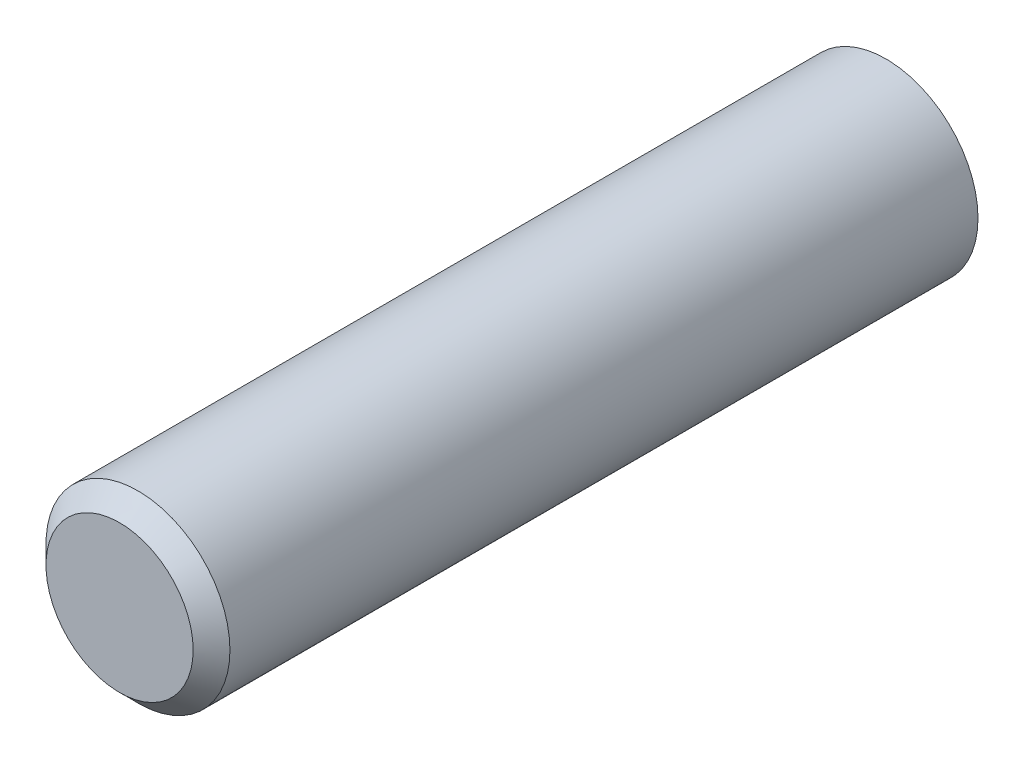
from build123d import *

# Parameters (mm, degrees)
SKETCH1_R           = 6
BOSS_EXTRUDE1_DEPTH = 25
CHAMFER1_SIZE       = 1.2


with BuildPart() as part:
    # Sketch1 → Boss-Extrude1 (new, symmetric)
    with BuildSketch(Plane.XY):
        Circle(SKETCH1_R)
    extrude(amount=BOSS_EXTRUDE1_DEPTH, both=True)

    # Chamfer1
    chamfer1_edges = [part.edges().sort_by_distance(p)[0] for p in [
        (-6, 0, 25),
    ]]
    chamfer(chamfer1_edges, length=CHAMFER1_SIZE)


solid = part.part
